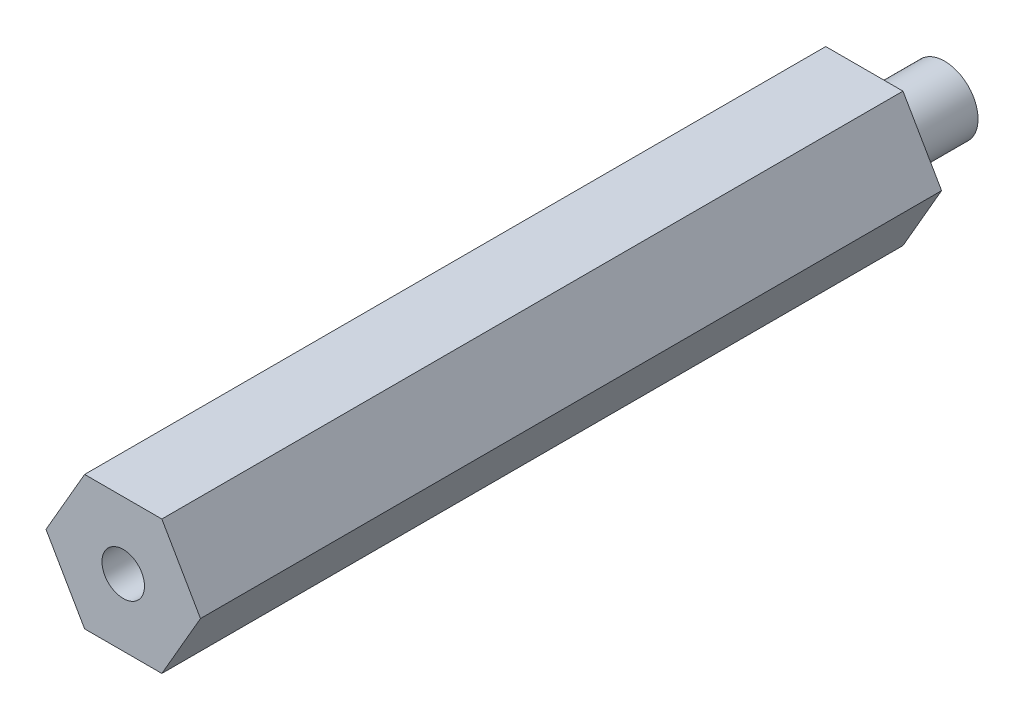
from build123d import *

# Parameters (mm, degrees)
BOSS_EXTRUDE1_DEPTH        = 77.978
SKETCH2_W                  = 4.157348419
SKETCH2_H                  = 7.62
F_10_32_TAPPED_HOLE1_D     = 4.0386
F_10_32_TAPPED_HOLE1_DEPTH = 12.7
F_10_32_TAPPED_HOLE1_TIP   = 1.213317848


with BuildPart() as part:
    # Sketch1 → Boss-Extrude1 (new body)
    with BuildSketch(Plane.XY):
        Polygon((7.332348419, 0), (3.666174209, 6.35), (-3.666174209, 6.35), (-7.332348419, 0), (-3.666174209, -6.35), (3.666174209, -6.35), align=None)
    extrude(amount=BOSS_EXTRUDE1_DEPTH)

    # Sketch2 → Cut-Revolve1 (revolve, cut)
    with BuildSketch(Plane(origin=(0, 0, 0), x_dir=(1, 0, 0), z_dir=(0, 1, 0)), mode=Mode.PRIVATE) as cut_revolve1_sk:
        with Locations((5.25367421, -3.81)):
            Rectangle(SKETCH2_W, SKETCH2_H)
    revolve(cut_revolve1_sk.sketch.rotate(Axis((0, 0, 0), (0, 0, 1)), 180), axis=Axis((0, 0, 0), (0, 0, 1)), mode=Mode.SUBTRACT)

    # 10-32 Tapped Hole1
    with Locations(Plane.XY.offset(77.978)):
        with Locations((0, 0)):
            Hole(F_10_32_TAPPED_HOLE1_D / 2, depth=F_10_32_TAPPED_HOLE1_DEPTH)
            with Locations((0, 0, -(F_10_32_TAPPED_HOLE1_DEPTH + F_10_32_TAPPED_HOLE1_TIP / 2))):  # 118° drill point
                Cone(0, F_10_32_TAPPED_HOLE1_D / 2, F_10_32_TAPPED_HOLE1_TIP, mode=Mode.SUBTRACT)


solid = part.part
